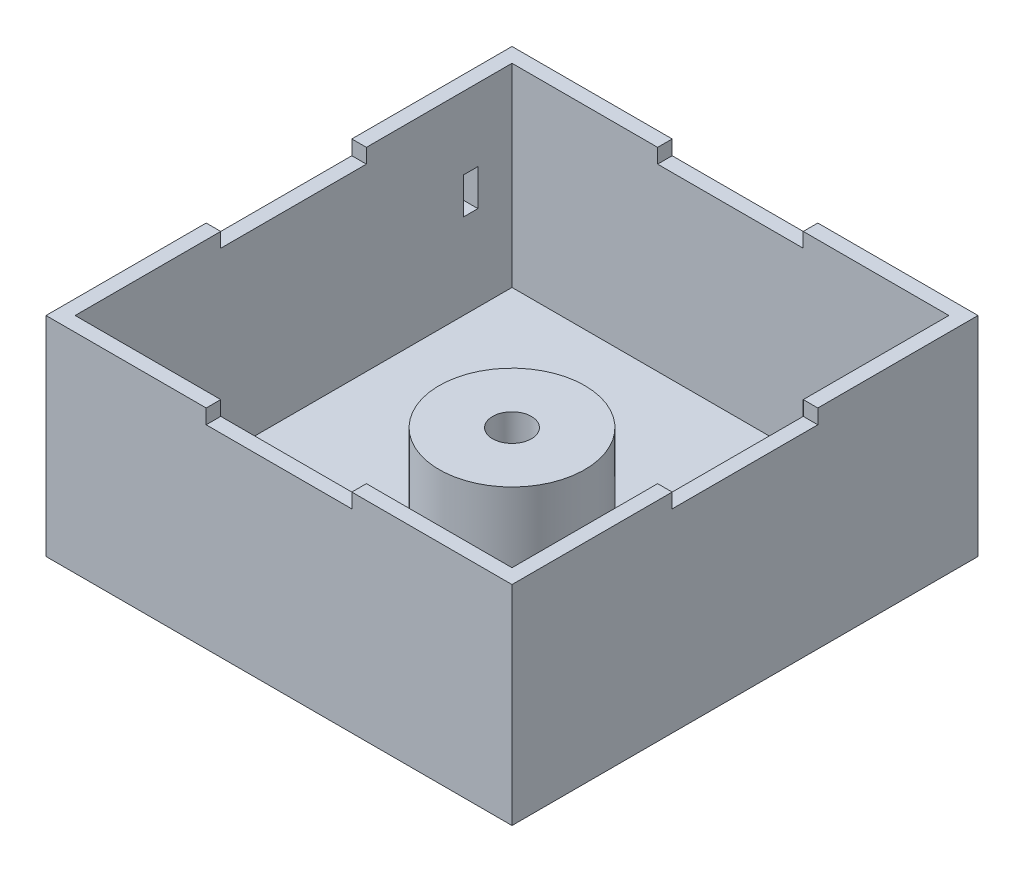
from build123d import *

# Parameters (mm, degrees)
SKETCH1_R               = 4
BOSS_EXTRUDE1_DEPTH     = 140
SKETCH2_R               = 15
SKETCH9_R               = 15
SKETCH3_W               = 96
SKETCH3_H               = 96
SKETCH3_W_2             = 90
SKETCH3_H_2             = 90
BOSS_EXTRUDE2_DEPTH     = 40
SKETCH4_W               = 96
SKETCH4_H               = 96
BOSS_EXTRUDE3_DEPTH     = 3
SKETCH5_W               = 3
SKETCH5_H               = 30
CUT_EXTRUDE1_DEPTH      = 3
CIRPATTERN1_COUNT       = 4
SKETCH8_W               = 3
SKETCH8_H               = 7.5
CUT_EXTRUDE2_DEPTH      = 10
CUT_EXTRUDE3_DEPTH      = 177.570099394
CUT_EXTRUDE3_DEPTH_BACK = 177.570099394
SKETCH10_R              = 4


with BuildPart() as part:
    # Sketch1 → Boss-Extrude1 (new body)
    with BuildSketch(Plane(origin=(0, 0, 0), x_dir=(1, 0, 0), z_dir=(0, 1, 0))):
        with Locations(Location((0, 0, 0), (0, 0, 270))):
            Circle(SKETCH1_R)
    extrude(amount=BOSS_EXTRUDE1_DEPTH)

    # Sketch2 → Loft1 section 0
    with BuildSketch(Plane(origin=(0, -20, 0), x_dir=(-1, 0, 0), z_dir=(0, -1, 0))):
        Circle(SKETCH2_R)
    # Sketch9 → Loft1 section 1
    with BuildSketch(Plane.XZ):
        Circle(SKETCH9_R)
    loft()



with BuildPart() as body_2:
    # Sketch3 → Boss-Extrude2 (new body)
    with BuildSketch(Plane(origin=(0, -20, 0), x_dir=(-1, 0, 0), z_dir=(0, -1, 0))):
        Rectangle(SKETCH3_W, SKETCH3_H)
        Rectangle(SKETCH3_W_2, SKETCH3_H_2, mode=Mode.SUBTRACT)
    extrude(amount=-BOSS_EXTRUDE2_DEPTH)


with BuildPart() as part_1:
    add(part.part)

    add(body_2.part)  # Boss-Extrude3 merges body 2
    # Sketch4 → Boss-Extrude3 (add)
    with BuildSketch(Plane(origin=(0, -20, 0), x_dir=(-1, 0, 0), z_dir=(0, -1, 0))):
        Rectangle(SKETCH4_W, SKETCH4_H)
    extrude(amount=BOSS_EXTRUDE3_DEPTH)

    # Sketch5 → Cut-Extrude1 (cut)
    with BuildSketch(Plane(origin=(0, 20, 0), x_dir=(1, 0, 0), z_dir=(0, 1, 0))):
        with Locations((-46.5, 0)):
            Rectangle(SKETCH5_W, SKETCH5_H)
    cut_extrude1 = extrude(amount=-CUT_EXTRUDE1_DEPTH, mode=Mode.SUBTRACT)

    # CirPattern1: Cut-Extrude1 ×4 about axis
    cirpattern1_axis = Axis((0, 0, 0), (0, 1, 0))
    for i in range(1, CIRPATTERN1_COUNT):
        add(cut_extrude1.rotate(cirpattern1_axis, i * 360 / CIRPATTERN1_COUNT), mode=Mode.SUBTRACT)

    # Sketch8 → Cut-Extrude2 (cut)
    with BuildSketch(Plane.ZY.offset(48)):
        with Locations((-36.478507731, 1.330218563)):
            Rectangle(SKETCH8_W, SKETCH8_H)
    extrude(amount=-CUT_EXTRUDE2_DEPTH, mode=Mode.SUBTRACT)

    # Sketch10 → Cut-Extrude3 (cut, two sides: drawn at the far end of the back side and taken through both)
    with BuildSketch(Plane(origin=(0, 140, 0), x_dir=(1, 0, 0), z_dir=(0, 1, 0)).offset(-CUT_EXTRUDE3_DEPTH_BACK)):
        with Locations(Location((0, 0, 0), (0, 0, 270))):
            Circle(SKETCH10_R)
    extrude(amount=CUT_EXTRUDE3_DEPTH + CUT_EXTRUDE3_DEPTH_BACK, mode=Mode.SUBTRACT)


solid = part_1.part
